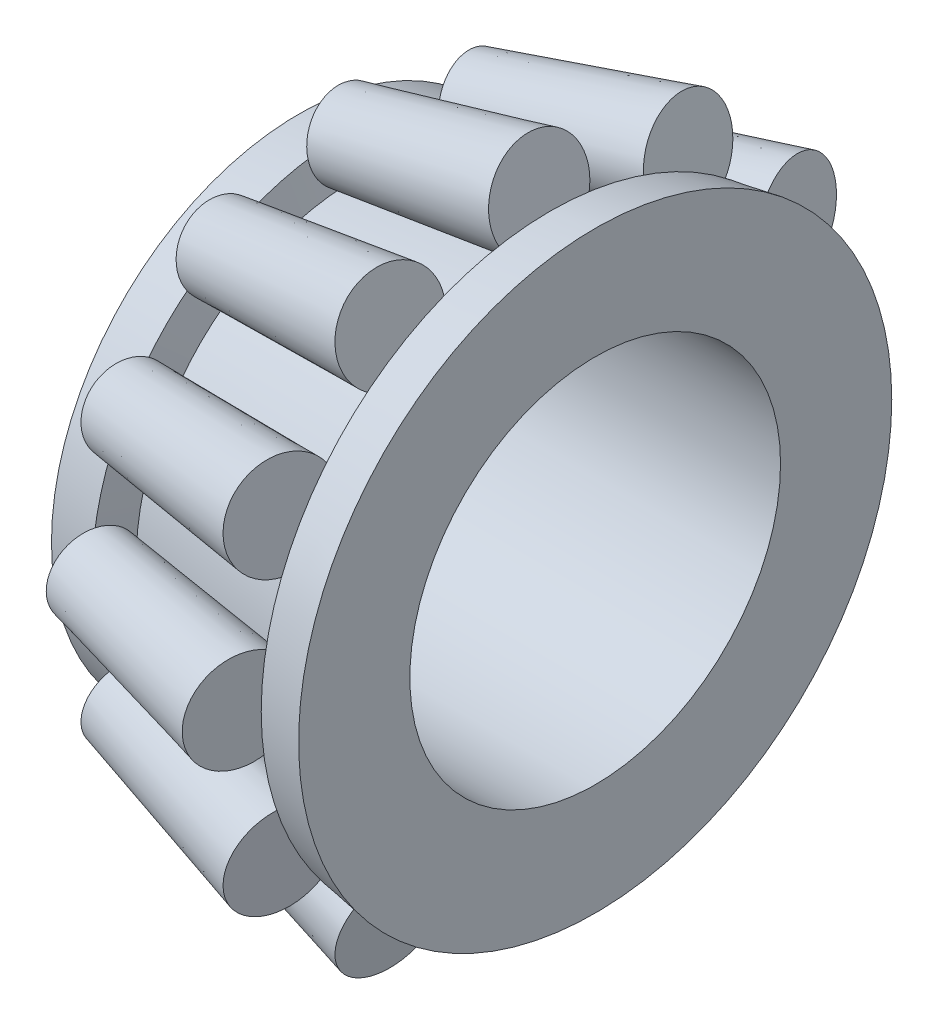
from build123d import *

# Parameters (mm, degrees)
R_P_TITION_CIRCULAIRE1_COUNT = 12


with BuildPart() as part:
    # Esquisse1 → Base-R_volution (revolve)
    with BuildSketch(Plane.XY, mode=Mode.PRIVATE) as base_r_volution_sk:
        Polygon((0, 7.5), (0, 12), (-1.815493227, 11.697417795), (-1.815493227, 10.176727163), (-9.706644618, 8.861535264), (-10.027212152, 10.328797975), (-12, 10), (-12, 7.5), align=None)
    revolve(base_r_volution_sk.sketch.rotate(Axis((40, 0, 0), (-1, 0, 0)), 90), axis=Axis((40, 0, 0), (-1, 0, 0)))

    # Esquisse2 → Boss.-R_vol.3 (revolve)
    with BuildSketch(Plane.XY):
        Polygon((-1.815493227, 10.1), (-9.671352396, 8.7), (-10.030719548, 10.260733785), (-2.264261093, 12.049001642), align=None)
    boss_r_vol_3 = revolve(axis=Axis((-2.264261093, 12.049001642, 0), (-0.9745008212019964, -0.22438393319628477, 0)))

    # R_p_tition circulaire1: Boss.-R_vol.3 ×12 about axis
    r_p_tition_circulaire1_axis = Axis((-10, 0, 0), (1, 0, 0))
    for i in range(1, R_P_TITION_CIRCULAIRE1_COUNT):
        add(boss_r_vol_3.rotate(r_p_tition_circulaire1_axis, i * 360 / R_P_TITION_CIRCULAIRE1_COUNT))


solid = part.part
